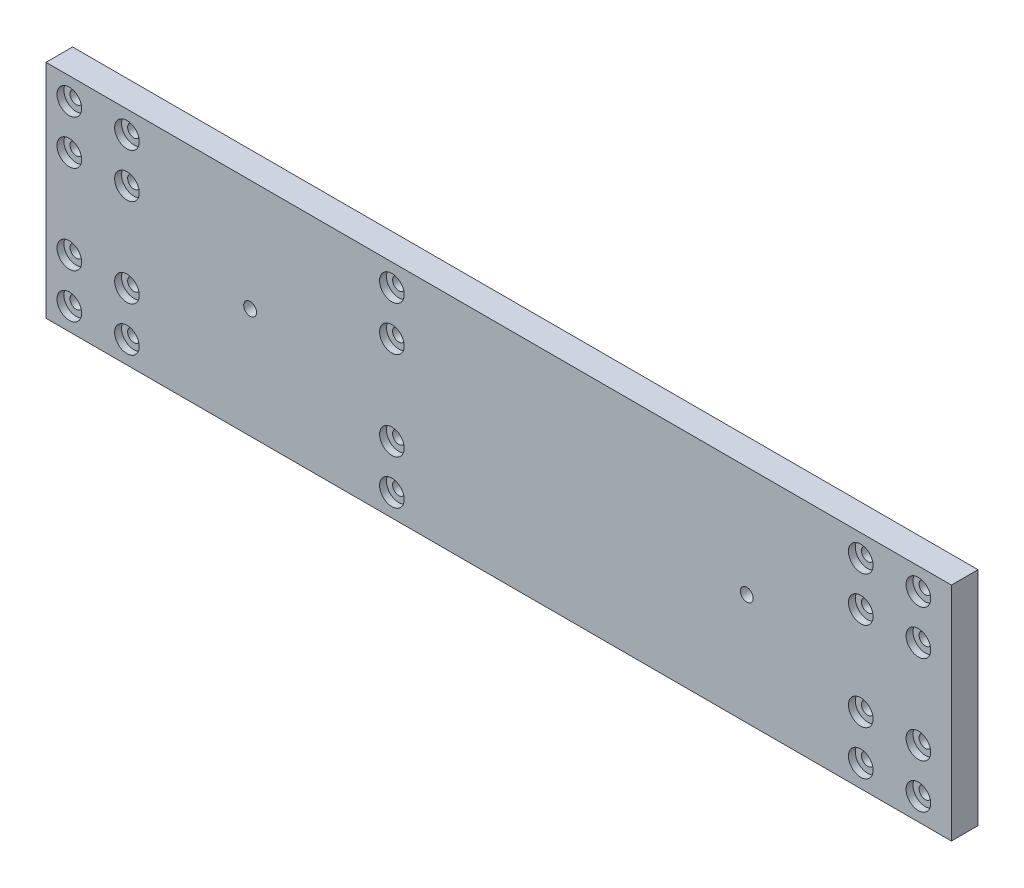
from build123d import *

# Parameters (mm, degrees)
SKETCH1_W                                           = 408.39898
SKETCH1_H                                           = 100
BOSS_EXTRUDE1_DEPTH                                 = 12
CBORE_FOR_10_BINDING_HEAD_MACHINE_SCREW_D           = 5.6134
CBORE_FOR_10_BINDING_HEAD_MACHINE_SCREW_CBORE_D     = 11.1125
CBORE_FOR_10_BINDING_HEAD_MACHINE_SCREW_CBORE_DEPTH = 3.1242
CBORE_FOR_M5_HEX_HEAD_BOLT5_D                       = 5.8
CBORE_FOR_M5_HEX_HEAD_BOLT5_CBORE_D                 = 12.24
CBORE_FOR_M5_HEX_HEAD_BOLT5_CBORE_DEPTH             = 3.58


with BuildPart() as part:
    # Sketch1 → Boss-Extrude1 (new body)
    with BuildSketch(Plane.XY):
        Rectangle(SKETCH1_W, SKETCH1_H)
    extrude(amount=BOSS_EXTRUDE1_DEPTH)

    # CBORE for _10 Binding Head Machine Screw (through all)
    with Locations(Plane(origin=(-193.6908, 40, 12), x_dir=(1, 0, 0), z_dir=(0, 0, 1))):
        with Locations((0, 0), (26, 0), (26, -20), (0, -20), (26, -80), (145.51024, 0), (145.51024, -20), (145.51024, -60), (145.51024, -80), (356.99954, 0), (382.99954, 0), (382.99954, -20), (356.99954, -20), (356.99954, -60), (382.99954, -60), (382.99954, -80), (356.99954, -80), (0, -80), (26, -60), (0, -60)):
            CounterBoreHole(CBORE_FOR_10_BINDING_HEAD_MACHINE_SCREW_D / 2, CBORE_FOR_10_BINDING_HEAD_MACHINE_SCREW_CBORE_D / 2, CBORE_FOR_10_BINDING_HEAD_MACHINE_SCREW_CBORE_DEPTH)

    # CBORE for M5 Hex Head Bolt5 (through all)
    with Locations(Plane(origin=(-112.126005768, -0.273846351, 0), x_dir=(-1, 0, 0), z_dir=(0, 0, -1))):
        with Locations((0, 0), (-224.030736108, 0.37214408)):
            CounterBoreHole(CBORE_FOR_M5_HEX_HEAD_BOLT5_D / 2, CBORE_FOR_M5_HEX_HEAD_BOLT5_CBORE_D / 2, CBORE_FOR_M5_HEX_HEAD_BOLT5_CBORE_DEPTH)


solid = part.part
